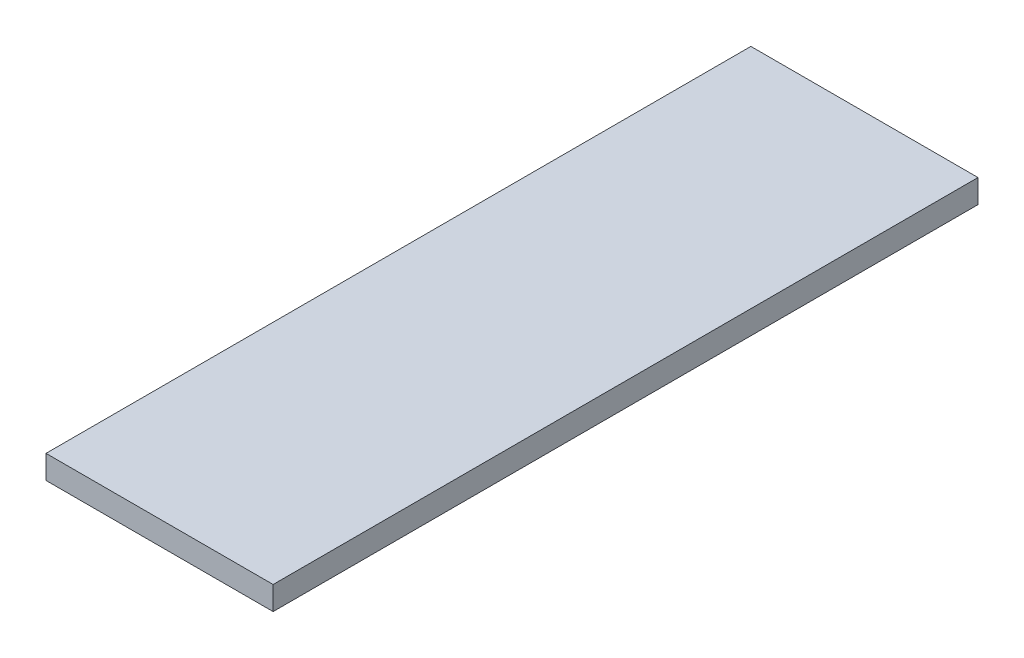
ISO-10303-21;
HEADER;
FILE_DESCRIPTION(('STEP AP214'),'2;1');
FILE_NAME('part.step','',(''),(''),'','','');
FILE_SCHEMA(('AUTOMOTIVE_DESIGN { 1 0 10303 214 1 1 1 1 }'));
ENDSEC;
DATA;
#1=APPLICATION_CONTEXT('core data for automotive mechanical design processes');
#2=APPLICATION_PROTOCOL_DEFINITION('international standard','automotive_design',2000,#1);
#3=PRODUCT_CONTEXT('',#1,'mechanical');
#4=PRODUCT('Part','Part','',(#3));
#5=PRODUCT_RELATED_PRODUCT_CATEGORY('part','',(#4));
#6=PRODUCT_DEFINITION_FORMATION('','',#4);
#7=PRODUCT_DEFINITION_CONTEXT('part definition',#1,'design');
#8=PRODUCT_DEFINITION('design','',#6,#7);
#9=PRODUCT_DEFINITION_SHAPE('','',#8);
#10=(LENGTH_UNIT() NAMED_UNIT(*) SI_UNIT(.MILLI.,.METRE.));
#11=(NAMED_UNIT(*) PLANE_ANGLE_UNIT() SI_UNIT($,.RADIAN.));
#12=(NAMED_UNIT(*) SI_UNIT($,.STERADIAN.) SOLID_ANGLE_UNIT());
#13=UNCERTAINTY_MEASURE_WITH_UNIT(LENGTH_MEASURE(1.E-05),#10,'distance_accuracy_value','');
#14=(GEOMETRIC_REPRESENTATION_CONTEXT(3) GLOBAL_UNCERTAINTY_ASSIGNED_CONTEXT((#13)) GLOBAL_UNIT_ASSIGNED_CONTEXT((#10,
#11,#12)) REPRESENTATION_CONTEXT('',''));
#15=CARTESIAN_POINT('',(0.,0.,0.));
#16=DIRECTION('',(0.,0.,1.));
#17=DIRECTION('',(1.,0.,0.));
#18=AXIS2_PLACEMENT_3D('',#15,#16,#17);
#19=CARTESIAN_POINT('',(23.01875,4.7625,-71.4375));
#20=DIRECTION('',(-1.,0.,0.));
#21=DIRECTION('',(0.,0.,1.));
#22=AXIS2_PLACEMENT_3D('',#19,#20,#21);
#23=PLANE('',#22);
#24=DIRECTION('',(0.,0.,-1.));
#25=VECTOR('',#24,1.);
#26=CARTESIAN_POINT('',(23.01875,0.,-71.4375));
#27=LINE('',#26,#25);
#28=CARTESIAN_POINT('',(23.01875,0.,71.4375));
#29=VERTEX_POINT('',#28);
#30=CARTESIAN_POINT('',(23.01875,0.,-71.4375));
#31=VERTEX_POINT('',#30);
#32=EDGE_CURVE('E99',#29,#31,#27,.T.);
#33=ORIENTED_EDGE('',*,*,#32,.T.);
#34=DIRECTION('',(0.,-1.,0.));
#35=VECTOR('',#34,1.);
#36=CARTESIAN_POINT('',(23.01875,4.7625,-71.4375));
#37=LINE('',#36,#35);
#38=CARTESIAN_POINT('',(23.01875,4.7625,-71.4375));
#39=VERTEX_POINT('',#38);
#40=EDGE_CURVE('E11',#39,#31,#37,.T.);
#41=ORIENTED_EDGE('',*,*,#40,.F.);
#42=DIRECTION('',(0.,0.,-1.));
#43=VECTOR('',#42,1.);
#44=CARTESIAN_POINT('',(23.01875,4.7625,-71.4375));
#45=LINE('',#44,#43);
#46=CARTESIAN_POINT('',(23.01875,4.7625,71.4375));
#47=VERTEX_POINT('',#46);
#48=EDGE_CURVE('E87',#47,#39,#45,.T.);
#49=ORIENTED_EDGE('',*,*,#48,.F.);
#50=DIRECTION('',(0.,-1.,0.));
#51=VECTOR('',#50,1.);
#52=CARTESIAN_POINT('',(23.01875,4.7625,71.4375));
#53=LINE('',#52,#51);
#54=EDGE_CURVE('E95',#47,#29,#53,.T.);
#55=ORIENTED_EDGE('',*,*,#54,.T.);
#56=EDGE_LOOP('',(#33,#41,#49,#55));
#57=FACE_BOUND('',#56,.T.);
#58=ADVANCED_FACE('F36',(#57),#23,.F.);
#59=CARTESIAN_POINT('',(-23.01875,4.7625,-71.4375));
#60=DIRECTION('',(0.,0.,1.));
#61=DIRECTION('',(1.,0.,0.));
#62=AXIS2_PLACEMENT_3D('',#59,#60,#61);
#63=PLANE('',#62);
#64=DIRECTION('',(-1.,0.,0.));
#65=VECTOR('',#64,1.);
#66=CARTESIAN_POINT('',(-23.01875,0.,-71.4375));
#67=LINE('',#66,#65);
#68=CARTESIAN_POINT('',(-23.01875,0.,-71.4375));
#69=VERTEX_POINT('',#68);
#70=EDGE_CURVE('E91',#31,#69,#67,.T.);
#71=ORIENTED_EDGE('',*,*,#70,.T.);
#72=DIRECTION('',(0.,-1.,0.));
#73=VECTOR('',#72,1.);
#74=CARTESIAN_POINT('',(-23.01875,4.7625,-71.4375));
#75=LINE('',#74,#73);
#76=CARTESIAN_POINT('',(-23.01875,4.7625,-71.4375));
#77=VERTEX_POINT('',#76);
#78=EDGE_CURVE('E44',#77,#69,#75,.T.);
#79=ORIENTED_EDGE('',*,*,#78,.F.);
#80=DIRECTION('',(-1.,0.,0.));
#81=VECTOR('',#80,1.);
#82=CARTESIAN_POINT('',(-23.01875,4.7625,-71.4375));
#83=LINE('',#82,#81);
#84=EDGE_CURVE('E82',#39,#77,#83,.T.);
#85=ORIENTED_EDGE('',*,*,#84,.F.);
#86=ORIENTED_EDGE('',*,*,#40,.T.);
#87=EDGE_LOOP('',(#71,#79,#85,#86));
#88=FACE_BOUND('',#87,.T.);
#89=ADVANCED_FACE('F90',(#88),#63,.F.);
#90=CARTESIAN_POINT('',(-23.01875,4.7625,-71.4375));
#91=DIRECTION('',(1.,0.,0.));
#92=DIRECTION('',(0.,0.,-1.));
#93=AXIS2_PLACEMENT_3D('',#90,#91,#92);
#94=PLANE('',#93);
#95=DIRECTION('',(0.,0.,1.));
#96=VECTOR('',#95,1.);
#97=CARTESIAN_POINT('',(-23.01875,0.,-71.4375));
#98=LINE('',#97,#96);
#99=CARTESIAN_POINT('',(-23.01875,0.,71.4375));
#100=VERTEX_POINT('',#99);
#101=EDGE_CURVE('E69',#69,#100,#98,.T.);
#102=ORIENTED_EDGE('',*,*,#101,.T.);
#103=DIRECTION('',(0.,-1.,0.));
#104=VECTOR('',#103,1.);
#105=CARTESIAN_POINT('',(-23.01875,4.7625,71.4375));
#106=LINE('',#105,#104);
#107=CARTESIAN_POINT('',(-23.01875,4.7625,71.4375));
#108=VERTEX_POINT('',#107);
#109=EDGE_CURVE('E92',#108,#100,#106,.T.);
#110=ORIENTED_EDGE('',*,*,#109,.F.);
#111=DIRECTION('',(0.,0.,1.));
#112=VECTOR('',#111,1.);
#113=CARTESIAN_POINT('',(-23.01875,4.7625,-71.4375));
#114=LINE('',#113,#112);
#115=EDGE_CURVE('E85',#77,#108,#114,.T.);
#116=ORIENTED_EDGE('',*,*,#115,.F.);
#117=ORIENTED_EDGE('',*,*,#78,.T.);
#118=EDGE_LOOP('',(#102,#110,#116,#117));
#119=FACE_BOUND('',#118,.T.);
#120=ADVANCED_FACE('F93',(#119),#94,.F.);
#121=CARTESIAN_POINT('',(-23.01875,4.7625,71.4375));
#122=DIRECTION('',(0.,0.,-1.));
#123=DIRECTION('',(-1.,0.,0.));
#124=AXIS2_PLACEMENT_3D('',#121,#122,#123);
#125=PLANE('',#124);
#126=DIRECTION('',(1.,0.,0.));
#127=VECTOR('',#126,1.);
#128=CARTESIAN_POINT('',(-23.01875,0.,71.4375));
#129=LINE('',#128,#127);
#130=EDGE_CURVE('E75',#100,#29,#129,.T.);
#131=ORIENTED_EDGE('',*,*,#130,.T.);
#132=ORIENTED_EDGE('',*,*,#54,.F.);
#133=DIRECTION('',(1.,0.,0.));
#134=VECTOR('',#133,1.);
#135=CARTESIAN_POINT('',(-23.01875,4.7625,71.4375));
#136=LINE('',#135,#134);
#137=EDGE_CURVE('E52',#108,#47,#136,.T.);
#138=ORIENTED_EDGE('',*,*,#137,.F.);
#139=ORIENTED_EDGE('',*,*,#109,.T.);
#140=EDGE_LOOP('',(#131,#132,#138,#139));
#141=FACE_BOUND('',#140,.T.);
#142=ADVANCED_FACE('F106',(#141),#125,.F.);
#143=CARTESIAN_POINT('',(23.01875,4.7625,71.4375));
#144=DIRECTION('',(0.,1.,0.));
#145=DIRECTION('',(0.,0.,1.));
#146=AXIS2_PLACEMENT_3D('',#143,#144,#145);
#147=PLANE('',#146);
#148=ORIENTED_EDGE('',*,*,#48,.T.);
#149=ORIENTED_EDGE('',*,*,#84,.T.);
#150=ORIENTED_EDGE('',*,*,#115,.T.);
#151=ORIENTED_EDGE('',*,*,#137,.T.);
#152=EDGE_LOOP('',(#148,#149,#150,#151));
#153=FACE_BOUND('',#152,.T.);
#154=ADVANCED_FACE('F83',(#153),#147,.T.);
#155=CARTESIAN_POINT('',(23.01875,0.,71.4375));
#156=DIRECTION('',(0.,1.,0.));
#157=DIRECTION('',(0.,0.,1.));
#158=AXIS2_PLACEMENT_3D('',#155,#156,#157);
#159=PLANE('',#158);
#160=ORIENTED_EDGE('',*,*,#32,.F.);
#161=ORIENTED_EDGE('',*,*,#130,.F.);
#162=ORIENTED_EDGE('',*,*,#101,.F.);
#163=ORIENTED_EDGE('',*,*,#70,.F.);
#164=EDGE_LOOP('',(#160,#161,#162,#163));
#165=FACE_BOUND('',#164,.T.);
#166=ADVANCED_FACE('F109',(#165),#159,.F.);
#167=CLOSED_SHELL('',(#58,#89,#120,#142,#154,#166));
#168=MANIFOLD_SOLID_BREP('B2',#167);
#169=ADVANCED_BREP_SHAPE_REPRESENTATION('',(#18,#168),#14);
#170=SHAPE_DEFINITION_REPRESENTATION(#9,#169);
ENDSEC;
END-ISO-10303-21;
